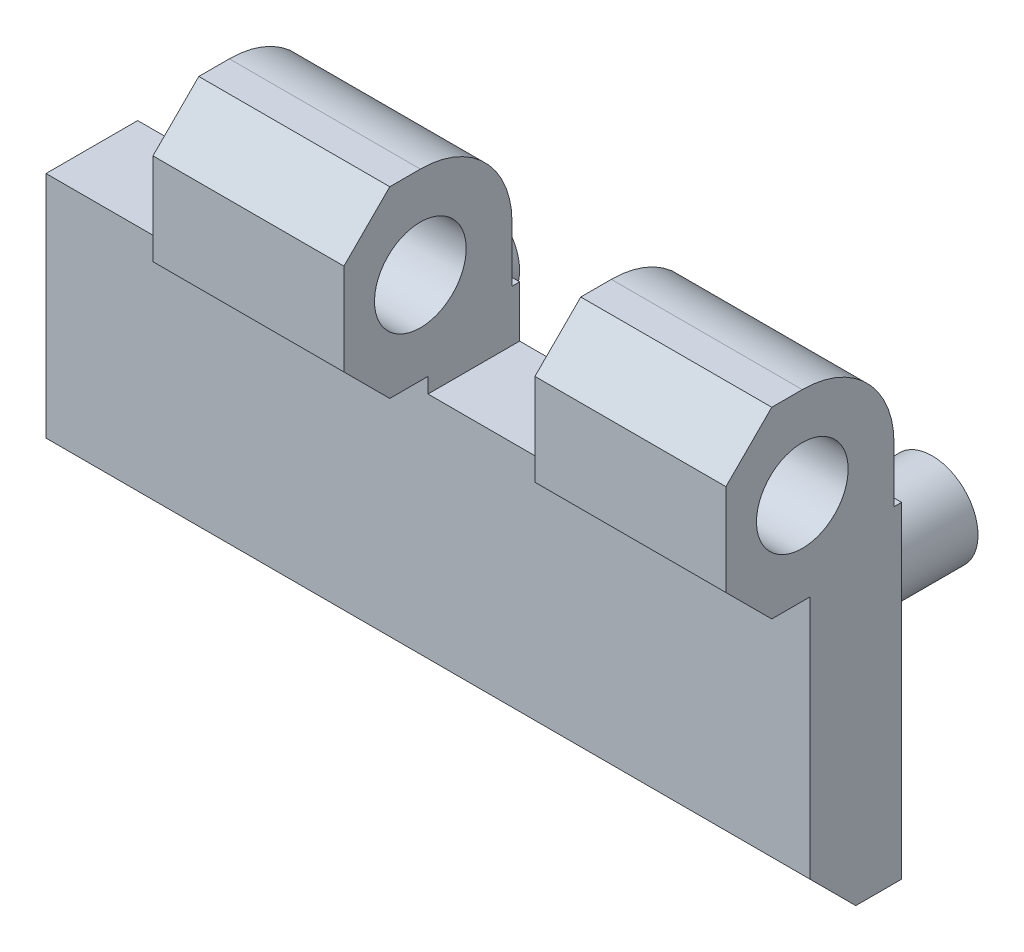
ISO-10303-21;
HEADER;
FILE_DESCRIPTION(('STEP AP214'),'2;1');
FILE_NAME('part.step','',(''),(''),'','','');
FILE_SCHEMA(('AUTOMOTIVE_DESIGN { 1 0 10303 214 1 1 1 1 }'));
ENDSEC;
DATA;
#1=APPLICATION_CONTEXT('core data for automotive mechanical design processes');
#2=APPLICATION_PROTOCOL_DEFINITION('international standard','automotive_design',2000,#1);
#3=PRODUCT_CONTEXT('',#1,'mechanical');
#4=PRODUCT('Part','Part','',(#3));
#5=PRODUCT_RELATED_PRODUCT_CATEGORY('part','',(#4));
#6=PRODUCT_DEFINITION_FORMATION('','',#4);
#7=PRODUCT_DEFINITION_CONTEXT('part definition',#1,'design');
#8=PRODUCT_DEFINITION('design','',#6,#7);
#9=PRODUCT_DEFINITION_SHAPE('','',#8);
#10=(LENGTH_UNIT() NAMED_UNIT(*) SI_UNIT(.MILLI.,.METRE.));
#11=(NAMED_UNIT(*) PLANE_ANGLE_UNIT() SI_UNIT($,.RADIAN.));
#12=(NAMED_UNIT(*) SI_UNIT($,.STERADIAN.) SOLID_ANGLE_UNIT());
#13=UNCERTAINTY_MEASURE_WITH_UNIT(LENGTH_MEASURE(1.E-05),#10,'distance_accuracy_value','');
#14=(GEOMETRIC_REPRESENTATION_CONTEXT(3) GLOBAL_UNCERTAINTY_ASSIGNED_CONTEXT((#13)) GLOBAL_UNIT_ASSIGNED_CONTEXT((#10,
#11,#12)) REPRESENTATION_CONTEXT('',''));
#15=CARTESIAN_POINT('',(0.,0.,0.));
#16=DIRECTION('',(0.,0.,1.));
#17=DIRECTION('',(1.,0.,0.));
#18=AXIS2_PLACEMENT_3D('',#15,#16,#17);
#19=CARTESIAN_POINT('',(-10.,-10.,0.));
#20=DIRECTION('',(0.,0.,-1.));
#21=DIRECTION('',(0.,1.,0.));
#22=AXIS2_PLACEMENT_3D('',#19,#20,#21);
#23=PLANE('',#22);
#24=DIRECTION('',(-1.,0.,0.));
#25=VECTOR('',#24,1.);
#26=CARTESIAN_POINT('',(-10.,8.,0.));
#27=LINE('',#26,#25);
#28=CARTESIAN_POINT('',(27.5,8.,0.));
#29=VERTEX_POINT('',#28);
#30=CARTESIAN_POINT('',(15.,8.,0.));
#31=VERTEX_POINT('',#30);
#32=EDGE_CURVE('E320',#29,#31,#27,.T.);
#33=ORIENTED_EDGE('',*,*,#32,.F.);
#34=DIRECTION('',(0.,1.,0.));
#35=VECTOR('',#34,1.);
#36=CARTESIAN_POINT('',(27.5,-10.,0.));
#37=LINE('',#36,#35);
#38=CARTESIAN_POINT('',(27.5,11.36,0.));
#39=VERTEX_POINT('',#38);
#40=EDGE_CURVE('E312',#29,#39,#37,.T.);
#41=ORIENTED_EDGE('',*,*,#40,.T.);
#42=DIRECTION('',(1.,0.,0.));
#43=VECTOR('',#42,1.);
#44=CARTESIAN_POINT('',(-10.,11.36,0.));
#45=LINE('',#44,#43);
#46=CARTESIAN_POINT('',(40.,11.36,0.));
#47=VERTEX_POINT('',#46);
#48=EDGE_CURVE('E351',#39,#47,#45,.T.);
#49=ORIENTED_EDGE('',*,*,#48,.T.);
#50=DIRECTION('',(0.,1.,0.));
#51=VECTOR('',#50,1.);
#52=CARTESIAN_POINT('',(40.,-10.,0.));
#53=LINE('',#52,#51);
#54=CARTESIAN_POINT('',(40.,-10.,0.));
#55=VERTEX_POINT('',#54);
#56=EDGE_CURVE('E194',#55,#47,#53,.T.);
#57=ORIENTED_EDGE('',*,*,#56,.F.);
#58=DIRECTION('',(1.,0.,0.));
#59=VECTOR('',#58,1.);
#60=CARTESIAN_POINT('',(-10.,-10.,0.));
#61=LINE('',#60,#59);
#62=CARTESIAN_POINT('',(-10.,-10.,0.));
#63=VERTEX_POINT('',#62);
#64=EDGE_CURVE('E189',#63,#55,#61,.T.);
#65=ORIENTED_EDGE('',*,*,#64,.F.);
#66=DIRECTION('',(0.,1.,0.));
#67=VECTOR('',#66,1.);
#68=CARTESIAN_POINT('',(-10.,-10.,0.));
#69=LINE('',#68,#67);
#70=CARTESIAN_POINT('',(-10.,8.,0.));
#71=VERTEX_POINT('',#70);
#72=EDGE_CURVE('E344',#63,#71,#69,.T.);
#73=ORIENTED_EDGE('',*,*,#72,.T.);
#74=DIRECTION('',(-1.,0.,0.));
#75=VECTOR('',#74,1.);
#76=CARTESIAN_POINT('',(-10.,8.,0.));
#77=LINE('',#76,#75);
#78=CARTESIAN_POINT('',(2.5,8.,0.));
#79=VERTEX_POINT('',#78);
#80=EDGE_CURVE('E318',#79,#71,#77,.T.);
#81=ORIENTED_EDGE('',*,*,#80,.F.);
#82=DIRECTION('',(0.,1.,0.));
#83=VECTOR('',#82,1.);
#84=CARTESIAN_POINT('',(2.5,-10.,0.));
#85=LINE('',#84,#83);
#86=CARTESIAN_POINT('',(2.5,11.36,0.));
#87=VERTEX_POINT('',#86);
#88=EDGE_CURVE('E266',#79,#87,#85,.T.);
#89=ORIENTED_EDGE('',*,*,#88,.T.);
#90=CARTESIAN_POINT('',(15.,11.36,0.));
#91=VERTEX_POINT('',#90);
#92=EDGE_CURVE('E353',#87,#91,#45,.T.);
#93=ORIENTED_EDGE('',*,*,#92,.T.);
#94=DIRECTION('',(0.,1.,0.));
#95=VECTOR('',#94,1.);
#96=CARTESIAN_POINT('',(15.,-10.,0.));
#97=LINE('',#96,#95);
#98=EDGE_CURVE('E291',#31,#91,#97,.T.);
#99=ORIENTED_EDGE('',*,*,#98,.F.);
#100=EDGE_LOOP('',(#33,#41,#49,#57,#65,#73,#81,#89,#93,#99));
#101=FACE_BOUND('',#100,.T.);
#102=CARTESIAN_POINT('',(30.,0.,0.));
#103=DIRECTION('',(0.,0.,-1.));
#104=DIRECTION('',(0.,1.,0.));
#105=AXIS2_PLACEMENT_3D('',#102,#103,#104);
#106=CIRCLE('',#105,3.);
#107=CARTESIAN_POINT('',(30.,3.,0.));
#108=VERTEX_POINT('',#107);
#109=EDGE_CURVE('E9',#108,#108,#106,.T.);
#110=ORIENTED_EDGE('',*,*,#109,.F.);
#111=EDGE_LOOP('',(#110));
#112=FACE_BOUND('',#111,.T.);
#113=CARTESIAN_POINT('',(0.,0.,0.));
#114=DIRECTION('',(0.,0.,-1.));
#115=DIRECTION('',(0.,1.,0.));
#116=AXIS2_PLACEMENT_3D('',#113,#114,#115);
#117=CIRCLE('',#116,3.);
#118=CARTESIAN_POINT('',(0.,3.,0.));
#119=VERTEX_POINT('',#118);
#120=EDGE_CURVE('E236',#119,#119,#117,.T.);
#121=ORIENTED_EDGE('',*,*,#120,.F.);
#122=EDGE_LOOP('',(#121));
#123=FACE_BOUND('',#122,.T.);
#124=ADVANCED_FACE('F14',(#101,#112,#123),#23,.T.);
#125=CARTESIAN_POINT('',(-10.,15.,6.5));
#126=DIRECTION('',(1.,0.,0.));
#127=DIRECTION('',(0.,1.,0.));
#128=AXIS2_PLACEMENT_3D('',#125,#126,#127);
#129=CYLINDRICAL_SURFACE('',#128,6.);
#130=DIRECTION('',(1.,0.,0.));
#131=VECTOR('',#130,1.);
#132=CARTESIAN_POINT('',(-10.,15.,0.5));
#133=LINE('',#132,#131);
#134=CARTESIAN_POINT('',(27.5,15.,0.5));
#135=VERTEX_POINT('',#134);
#136=CARTESIAN_POINT('',(40.,15.,0.5));
#137=VERTEX_POINT('',#136);
#138=EDGE_CURVE('E357',#135,#137,#133,.T.);
#139=ORIENTED_EDGE('',*,*,#138,.F.);
#140=CARTESIAN_POINT('',(27.5,15.,6.5));
#141=DIRECTION('',(-1.,0.,0.));
#142=DIRECTION('',(0.,-1.,0.));
#143=AXIS2_PLACEMENT_3D('',#140,#141,#142);
#144=CIRCLE('',#143,6.);
#145=CARTESIAN_POINT('',(27.5,21.,6.5));
#146=VERTEX_POINT('',#145);
#147=EDGE_CURVE('E300',#135,#146,#144,.F.);
#148=ORIENTED_EDGE('',*,*,#147,.T.);
#149=DIRECTION('',(1.,0.,0.));
#150=VECTOR('',#149,1.);
#151=CARTESIAN_POINT('',(-10.,21.,6.5));
#152=LINE('',#151,#150);
#153=CARTESIAN_POINT('',(40.,21.,6.5));
#154=VERTEX_POINT('',#153);
#155=EDGE_CURVE('E347',#146,#154,#152,.T.);
#156=ORIENTED_EDGE('',*,*,#155,.T.);
#157=CARTESIAN_POINT('',(40.,15.,6.5));
#158=DIRECTION('',(1.,0.,0.));
#159=DIRECTION('',(0.,1.,0.));
#160=AXIS2_PLACEMENT_3D('',#157,#158,#159);
#161=CIRCLE('',#160,6.);
#162=EDGE_CURVE('E325',#137,#154,#161,.T.);
#163=ORIENTED_EDGE('',*,*,#162,.F.);
#164=EDGE_LOOP('',(#139,#148,#156,#163));
#165=FACE_BOUND('',#164,.T.);
#166=ADVANCED_FACE('F468',(#165),#129,.T.);
#167=CARTESIAN_POINT('',(15.,15.,6.5));
#168=DIRECTION('',(-1.,0.,0.));
#169=DIRECTION('',(0.,-1.,0.));
#170=AXIS2_PLACEMENT_3D('',#167,#168,#169);
#171=CIRCLE('',#170,6.);
#172=CARTESIAN_POINT('',(15.,15.,0.5));
#173=VERTEX_POINT('',#172);
#174=CARTESIAN_POINT('',(15.,21.,6.5));
#175=VERTEX_POINT('',#174);
#176=EDGE_CURVE('E278',#173,#175,#171,.F.);
#177=ORIENTED_EDGE('',*,*,#176,.F.);
#178=CARTESIAN_POINT('',(2.5,15.,0.5));
#179=VERTEX_POINT('',#178);
#180=EDGE_CURVE('E359',#179,#173,#133,.T.);
#181=ORIENTED_EDGE('',*,*,#180,.F.);
#182=CARTESIAN_POINT('',(2.5,15.,6.5));
#183=DIRECTION('',(-1.,0.,0.));
#184=DIRECTION('',(0.,-1.,0.));
#185=AXIS2_PLACEMENT_3D('',#182,#183,#184);
#186=CIRCLE('',#185,6.);
#187=CARTESIAN_POINT('',(2.5,21.,6.5));
#188=VERTEX_POINT('',#187);
#189=EDGE_CURVE('E255',#179,#188,#186,.F.);
#190=ORIENTED_EDGE('',*,*,#189,.T.);
#191=EDGE_CURVE('E349',#188,#175,#152,.T.);
#192=ORIENTED_EDGE('',*,*,#191,.T.);
#193=EDGE_LOOP('',(#177,#181,#190,#192));
#194=FACE_BOUND('',#193,.T.);
#195=ADVANCED_FACE('F425',(#194),#129,.T.);
#196=CARTESIAN_POINT('',(-10.,15.,0.5));
#197=DIRECTION('',(0.,0.,1.));
#198=DIRECTION('',(0.,-1.,0.));
#199=AXIS2_PLACEMENT_3D('',#196,#197,#198);
#200=PLANE('',#199);
#201=DIRECTION('',(0.,-1.,0.));
#202=VECTOR('',#201,1.);
#203=CARTESIAN_POINT('',(27.5,15.,0.5));
#204=LINE('',#203,#202);
#205=CARTESIAN_POINT('',(27.5,11.36,0.5));
#206=VERTEX_POINT('',#205);
#207=EDGE_CURVE('E308',#135,#206,#204,.T.);
#208=ORIENTED_EDGE('',*,*,#207,.F.);
#209=ORIENTED_EDGE('',*,*,#138,.T.);
#210=DIRECTION('',(0.,-1.,0.));
#211=VECTOR('',#210,1.);
#212=CARTESIAN_POINT('',(40.,15.,0.5));
#213=LINE('',#212,#211);
#214=CARTESIAN_POINT('',(40.,11.36,0.5));
#215=VERTEX_POINT('',#214);
#216=EDGE_CURVE('E339',#137,#215,#213,.T.);
#217=ORIENTED_EDGE('',*,*,#216,.T.);
#218=DIRECTION('',(1.,0.,0.));
#219=VECTOR('',#218,1.);
#220=CARTESIAN_POINT('',(-10.,11.36,0.5));
#221=LINE('',#220,#219);
#222=EDGE_CURVE('E354',#206,#215,#221,.T.);
#223=ORIENTED_EDGE('',*,*,#222,.F.);
#224=EDGE_LOOP('',(#208,#209,#217,#223));
#225=FACE_BOUND('',#224,.T.);
#226=ADVANCED_FACE('F16',(#225),#200,.F.);
#227=ORIENTED_EDGE('',*,*,#180,.T.);
#228=DIRECTION('',(0.,-1.,0.));
#229=VECTOR('',#228,1.);
#230=CARTESIAN_POINT('',(15.,15.,0.5));
#231=LINE('',#230,#229);
#232=CARTESIAN_POINT('',(15.,11.36,0.5));
#233=VERTEX_POINT('',#232);
#234=EDGE_CURVE('E285',#173,#233,#231,.T.);
#235=ORIENTED_EDGE('',*,*,#234,.T.);
#236=CARTESIAN_POINT('',(2.5,11.36,0.5));
#237=VERTEX_POINT('',#236);
#238=EDGE_CURVE('E356',#237,#233,#221,.T.);
#239=ORIENTED_EDGE('',*,*,#238,.F.);
#240=DIRECTION('',(0.,-1.,0.));
#241=VECTOR('',#240,1.);
#242=CARTESIAN_POINT('',(2.5,15.,0.5));
#243=LINE('',#242,#241);
#244=EDGE_CURVE('E262',#179,#237,#243,.T.);
#245=ORIENTED_EDGE('',*,*,#244,.F.);
#246=EDGE_LOOP('',(#227,#235,#239,#245));
#247=FACE_BOUND('',#246,.T.);
#248=ADVANCED_FACE('F421',(#247),#200,.F.);
#249=CARTESIAN_POINT('',(-10.,11.36,0.5));
#250=DIRECTION('',(0.,-1.,0.));
#251=DIRECTION('',(1.,0.,0.));
#252=AXIS2_PLACEMENT_3D('',#249,#250,#251);
#253=PLANE('',#252);
#254=DIRECTION('',(0.,0.,-1.));
#255=VECTOR('',#254,1.);
#256=CARTESIAN_POINT('',(27.5,11.36,0.5));
#257=LINE('',#256,#255);
#258=EDGE_CURVE('E310',#206,#39,#257,.T.);
#259=ORIENTED_EDGE('',*,*,#258,.F.);
#260=ORIENTED_EDGE('',*,*,#222,.T.);
#261=DIRECTION('',(0.,0.,-1.));
#262=VECTOR('',#261,1.);
#263=CARTESIAN_POINT('',(40.,11.36,0.5));
#264=LINE('',#263,#262);
#265=EDGE_CURVE('E336',#215,#47,#264,.T.);
#266=ORIENTED_EDGE('',*,*,#265,.T.);
#267=ORIENTED_EDGE('',*,*,#48,.F.);
#268=EDGE_LOOP('',(#259,#260,#266,#267));
#269=FACE_BOUND('',#268,.T.);
#270=ADVANCED_FACE('F459',(#269),#253,.F.);
#271=ORIENTED_EDGE('',*,*,#238,.T.);
#272=DIRECTION('',(0.,0.,-1.));
#273=VECTOR('',#272,1.);
#274=CARTESIAN_POINT('',(15.,11.36,0.5));
#275=LINE('',#274,#273);
#276=EDGE_CURVE('E288',#233,#91,#275,.T.);
#277=ORIENTED_EDGE('',*,*,#276,.T.);
#278=ORIENTED_EDGE('',*,*,#92,.F.);
#279=DIRECTION('',(0.,0.,-1.));
#280=VECTOR('',#279,1.);
#281=CARTESIAN_POINT('',(2.5,11.36,0.5));
#282=LINE('',#281,#280);
#283=EDGE_CURVE('E264',#237,#87,#282,.T.);
#284=ORIENTED_EDGE('',*,*,#283,.F.);
#285=EDGE_LOOP('',(#271,#277,#278,#284));
#286=FACE_BOUND('',#285,.T.);
#287=ADVANCED_FACE('F412',(#286),#253,.F.);
#288=CARTESIAN_POINT('',(-10.,9.,11.5));
#289=DIRECTION('',(0.,-1.,0.));
#290=DIRECTION('',(1.,0.,0.));
#291=AXIS2_PLACEMENT_3D('',#288,#289,#290);
#292=PLANE('',#291);
#293=DIRECTION('',(-1.,0.,0.));
#294=VECTOR('',#293,1.);
#295=CARTESIAN_POINT('',(40.,9.,6.));
#296=LINE('',#295,#294);
#297=CARTESIAN_POINT('',(40.,9.,6.));
#298=VERTEX_POINT('',#297);
#299=CARTESIAN_POINT('',(27.5,9.,6.));
#300=VERTEX_POINT('',#299);
#301=EDGE_CURVE('E30',#298,#300,#296,.T.);
#302=ORIENTED_EDGE('',*,*,#301,.F.);
#303=DIRECTION('',(0.,0.,-1.));
#304=VECTOR('',#303,1.);
#305=CARTESIAN_POINT('',(40.,9.,11.5));
#306=LINE('',#305,#304);
#307=CARTESIAN_POINT('',(40.,9.,8.5));
#308=VERTEX_POINT('',#307);
#309=EDGE_CURVE('E195',#308,#298,#306,.T.);
#310=ORIENTED_EDGE('',*,*,#309,.F.);
#311=DIRECTION('',(-1.,0.,0.));
#312=VECTOR('',#311,1.);
#313=CARTESIAN_POINT('',(-10.,9.,8.5));
#314=LINE('',#313,#312);
#315=CARTESIAN_POINT('',(27.5,9.,8.5));
#316=VERTEX_POINT('',#315);
#317=EDGE_CURVE('E371',#308,#316,#314,.T.);
#318=ORIENTED_EDGE('',*,*,#317,.T.);
#319=DIRECTION('',(0.,0.,-1.));
#320=VECTOR('',#319,1.);
#321=CARTESIAN_POINT('',(27.5,9.,11.5));
#322=LINE('',#321,#320);
#323=EDGE_CURVE('E306',#316,#300,#322,.T.);
#324=ORIENTED_EDGE('',*,*,#323,.T.);
#325=EDGE_LOOP('',(#302,#310,#318,#324));
#326=FACE_BOUND('',#325,.T.);
#327=ADVANCED_FACE('F484',(#326),#292,.T.);
#328=DIRECTION('',(-1.,0.,0.));
#329=VECTOR('',#328,1.);
#330=CARTESIAN_POINT('',(15.,9.,6.));
#331=LINE('',#330,#329);
#332=CARTESIAN_POINT('',(15.,9.,6.));
#333=VERTEX_POINT('',#332);
#334=CARTESIAN_POINT('',(2.5,9.,6.));
#335=VERTEX_POINT('',#334);
#336=EDGE_CURVE('E222',#333,#335,#331,.T.);
#337=ORIENTED_EDGE('',*,*,#336,.F.);
#338=DIRECTION('',(0.,0.,-1.));
#339=VECTOR('',#338,1.);
#340=CARTESIAN_POINT('',(15.,9.,11.5));
#341=LINE('',#340,#339);
#342=CARTESIAN_POINT('',(15.,9.,8.5));
#343=VERTEX_POINT('',#342);
#344=EDGE_CURVE('E282',#343,#333,#341,.T.);
#345=ORIENTED_EDGE('',*,*,#344,.F.);
#346=CARTESIAN_POINT('',(2.5,9.,8.5));
#347=VERTEX_POINT('',#346);
#348=EDGE_CURVE('E375',#343,#347,#314,.T.);
#349=ORIENTED_EDGE('',*,*,#348,.T.);
#350=DIRECTION('',(0.,0.,-1.));
#351=VECTOR('',#350,1.);
#352=CARTESIAN_POINT('',(2.5,9.,11.5));
#353=LINE('',#352,#351);
#354=EDGE_CURVE('E38',#347,#335,#353,.T.);
#355=ORIENTED_EDGE('',*,*,#354,.T.);
#356=EDGE_LOOP('',(#337,#345,#349,#355));
#357=FACE_BOUND('',#356,.T.);
#358=ADVANCED_FACE('F447',(#357),#292,.T.);
#359=CARTESIAN_POINT('',(-10.,9.,11.5));
#360=DIRECTION('',(0.,0.,-1.));
#361=DIRECTION('',(-1.,0.,0.));
#362=AXIS2_PLACEMENT_3D('',#359,#360,#361);
#363=PLANE('',#362);
#364=DIRECTION('',(0.,1.,0.));
#365=VECTOR('',#364,1.);
#366=CARTESIAN_POINT('',(27.5,9.,11.5));
#367=LINE('',#366,#365);
#368=CARTESIAN_POINT('',(27.5,12.,11.5));
#369=VERTEX_POINT('',#368);
#370=CARTESIAN_POINT('',(27.5,18.,11.5));
#371=VERTEX_POINT('',#370);
#372=EDGE_CURVE('E298',#369,#371,#367,.T.);
#373=ORIENTED_EDGE('',*,*,#372,.F.);
#374=DIRECTION('',(1.,0.,0.));
#375=VECTOR('',#374,1.);
#376=CARTESIAN_POINT('',(40.,12.,11.5));
#377=LINE('',#376,#375);
#378=CARTESIAN_POINT('',(40.,12.,11.5));
#379=VERTEX_POINT('',#378);
#380=EDGE_CURVE('E368',#369,#379,#377,.T.);
#381=ORIENTED_EDGE('',*,*,#380,.T.);
#382=DIRECTION('',(0.,1.,0.));
#383=VECTOR('',#382,1.);
#384=CARTESIAN_POINT('',(40.,9.,11.5));
#385=LINE('',#384,#383);
#386=CARTESIAN_POINT('',(40.,18.,11.5));
#387=VERTEX_POINT('',#386);
#388=EDGE_CURVE('E331',#379,#387,#385,.T.);
#389=ORIENTED_EDGE('',*,*,#388,.T.);
#390=DIRECTION('',(-1.,0.,0.));
#391=VECTOR('',#390,1.);
#392=CARTESIAN_POINT('',(-10.,18.,11.5));
#393=LINE('',#392,#391);
#394=EDGE_CURVE('E365',#387,#371,#393,.T.);
#395=ORIENTED_EDGE('',*,*,#394,.T.);
#396=EDGE_LOOP('',(#373,#381,#389,#395));
#397=FACE_BOUND('',#396,.T.);
#398=ADVANCED_FACE('F479',(#397),#363,.F.);
#399=CARTESIAN_POINT('',(2.5,12.,11.5));
#400=VERTEX_POINT('',#399);
#401=CARTESIAN_POINT('',(15.,12.,11.5));
#402=VERTEX_POINT('',#401);
#403=EDGE_CURVE('E370',#400,#402,#377,.T.);
#404=ORIENTED_EDGE('',*,*,#403,.T.);
#405=DIRECTION('',(0.,1.,0.));
#406=VECTOR('',#405,1.);
#407=CARTESIAN_POINT('',(15.,9.,11.5));
#408=LINE('',#407,#406);
#409=CARTESIAN_POINT('',(15.,18.,11.5));
#410=VERTEX_POINT('',#409);
#411=EDGE_CURVE('E275',#402,#410,#408,.T.);
#412=ORIENTED_EDGE('',*,*,#411,.T.);
#413=CARTESIAN_POINT('',(2.5,18.,11.5));
#414=VERTEX_POINT('',#413);
#415=EDGE_CURVE('E364',#410,#414,#393,.T.);
#416=ORIENTED_EDGE('',*,*,#415,.T.);
#417=DIRECTION('',(0.,1.,0.));
#418=VECTOR('',#417,1.);
#419=CARTESIAN_POINT('',(2.5,9.,11.5));
#420=LINE('',#419,#418);
#421=EDGE_CURVE('E253',#400,#414,#420,.T.);
#422=ORIENTED_EDGE('',*,*,#421,.F.);
#423=EDGE_LOOP('',(#404,#412,#416,#422));
#424=FACE_BOUND('',#423,.T.);
#425=ADVANCED_FACE('F441',(#424),#363,.F.);
#426=CARTESIAN_POINT('',(-10.,21.,11.5));
#427=DIRECTION('',(0.,-1.,0.));
#428=DIRECTION('',(0.,0.,-1.));
#429=AXIS2_PLACEMENT_3D('',#426,#427,#428);
#430=PLANE('',#429);
#431=DIRECTION('',(0.,0.,-1.));
#432=VECTOR('',#431,1.);
#433=CARTESIAN_POINT('',(27.5,21.,11.5));
#434=LINE('',#433,#432);
#435=CARTESIAN_POINT('',(27.5,21.,8.5));
#436=VERTEX_POINT('',#435);
#437=EDGE_CURVE('E296',#436,#146,#434,.T.);
#438=ORIENTED_EDGE('',*,*,#437,.F.);
#439=DIRECTION('',(1.,0.,0.));
#440=VECTOR('',#439,1.);
#441=CARTESIAN_POINT('',(-10.,21.,8.5));
#442=LINE('',#441,#440);
#443=CARTESIAN_POINT('',(40.,21.,8.5));
#444=VERTEX_POINT('',#443);
#445=EDGE_CURVE('E374',#436,#444,#442,.T.);
#446=ORIENTED_EDGE('',*,*,#445,.T.);
#447=DIRECTION('',(0.,0.,-1.));
#448=VECTOR('',#447,1.);
#449=CARTESIAN_POINT('',(40.,21.,11.5));
#450=LINE('',#449,#448);
#451=EDGE_CURVE('E328',#444,#154,#450,.T.);
#452=ORIENTED_EDGE('',*,*,#451,.T.);
#453=ORIENTED_EDGE('',*,*,#155,.F.);
#454=EDGE_LOOP('',(#438,#446,#452,#453));
#455=FACE_BOUND('',#454,.T.);
#456=ADVANCED_FACE('F475',(#455),#430,.F.);
#457=CARTESIAN_POINT('',(2.5,21.,8.5));
#458=VERTEX_POINT('',#457);
#459=CARTESIAN_POINT('',(15.,21.,8.5));
#460=VERTEX_POINT('',#459);
#461=EDGE_CURVE('E377',#458,#460,#442,.T.);
#462=ORIENTED_EDGE('',*,*,#461,.T.);
#463=DIRECTION('',(0.,0.,-1.));
#464=VECTOR('',#463,1.);
#465=CARTESIAN_POINT('',(15.,21.,11.5));
#466=LINE('',#465,#464);
#467=EDGE_CURVE('E272',#460,#175,#466,.T.);
#468=ORIENTED_EDGE('',*,*,#467,.T.);
#469=ORIENTED_EDGE('',*,*,#191,.F.);
#470=DIRECTION('',(0.,0.,-1.));
#471=VECTOR('',#470,1.);
#472=CARTESIAN_POINT('',(2.5,21.,11.5));
#473=LINE('',#472,#471);
#474=EDGE_CURVE('E251',#458,#188,#473,.T.);
#475=ORIENTED_EDGE('',*,*,#474,.F.);
#476=EDGE_LOOP('',(#462,#468,#469,#475));
#477=FACE_BOUND('',#476,.T.);
#478=ADVANCED_FACE('F431',(#477),#430,.F.);
#479=CARTESIAN_POINT('',(-10.,15.,6.5));
#480=DIRECTION('',(1.,0.,0.));
#481=DIRECTION('',(0.,1.,0.));
#482=AXIS2_PLACEMENT_3D('',#479,#480,#481);
#483=CYLINDRICAL_SURFACE('',#482,3.);
#484=CARTESIAN_POINT('',(40.,15.,6.5));
#485=DIRECTION('',(1.,0.,0.));
#486=DIRECTION('',(0.,1.,0.));
#487=AXIS2_PLACEMENT_3D('',#484,#485,#486);
#488=CIRCLE('',#487,3.);
#489=CARTESIAN_POINT('',(40.,18.,6.5));
#490=VERTEX_POINT('',#489);
#491=EDGE_CURVE('E322',#490,#490,#488,.T.);
#492=ORIENTED_EDGE('',*,*,#491,.T.);
#493=EDGE_LOOP('',(#492));
#494=FACE_BOUND('',#493,.T.);
#495=CARTESIAN_POINT('',(27.5,15.,6.5));
#496=DIRECTION('',(-1.,0.,0.));
#497=DIRECTION('',(0.,-1.,0.));
#498=AXIS2_PLACEMENT_3D('',#495,#496,#497);
#499=CIRCLE('',#498,3.);
#500=CARTESIAN_POINT('',(27.5,12.,6.5));
#501=VERTEX_POINT('',#500);
#502=EDGE_CURVE('E315',#501,#501,#499,.F.);
#503=ORIENTED_EDGE('',*,*,#502,.F.);
#504=EDGE_LOOP('',(#503));
#505=FACE_BOUND('',#504,.T.);
#506=ADVANCED_FACE('F492',(#494,#505),#483,.F.);
#507=CARTESIAN_POINT('',(-10.,12.,11.5));
#508=DIRECTION('',(0.,-0.707106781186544,0.707106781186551));
#509=DIRECTION('',(0.,-0.707106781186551,-0.707106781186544));
#510=AXIS2_PLACEMENT_3D('',#507,#508,#509);
#511=PLANE('',#510);
#512=ORIENTED_EDGE('',*,*,#380,.F.);
#513=DIRECTION('',(0.,-0.707106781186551,-0.707106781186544));
#514=VECTOR('',#513,1.);
#515=CARTESIAN_POINT('',(27.5,12.,11.5));
#516=LINE('',#515,#514);
#517=EDGE_CURVE('E303',#369,#316,#516,.T.);
#518=ORIENTED_EDGE('',*,*,#517,.T.);
#519=ORIENTED_EDGE('',*,*,#317,.F.);
#520=DIRECTION('',(0.,-0.707106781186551,-0.707106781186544));
#521=VECTOR('',#520,1.);
#522=CARTESIAN_POINT('',(40.,11.,10.5));
#523=LINE('',#522,#521);
#524=EDGE_CURVE('E362',#379,#308,#523,.T.);
#525=ORIENTED_EDGE('',*,*,#524,.F.);
#526=EDGE_LOOP('',(#512,#518,#519,#525));
#527=FACE_BOUND('',#526,.T.);
#528=ADVANCED_FACE('F485',(#527),#511,.T.);
#529=DIRECTION('',(0.,-0.707106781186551,-0.707106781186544));
#530=VECTOR('',#529,1.);
#531=CARTESIAN_POINT('',(15.,12.,11.5));
#532=LINE('',#531,#530);
#533=EDGE_CURVE('E280',#402,#343,#532,.T.);
#534=ORIENTED_EDGE('',*,*,#533,.F.);
#535=ORIENTED_EDGE('',*,*,#403,.F.);
#536=DIRECTION('',(0.,-0.707106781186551,-0.707106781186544));
#537=VECTOR('',#536,1.);
#538=CARTESIAN_POINT('',(2.5,12.,11.5));
#539=LINE('',#538,#537);
#540=EDGE_CURVE('E258',#400,#347,#539,.T.);
#541=ORIENTED_EDGE('',*,*,#540,.T.);
#542=ORIENTED_EDGE('',*,*,#348,.F.);
#543=EDGE_LOOP('',(#534,#535,#541,#542));
#544=FACE_BOUND('',#543,.T.);
#545=ADVANCED_FACE('F448',(#544),#511,.T.);
#546=CARTESIAN_POINT('',(-10.,21.,8.5));
#547=DIRECTION('',(0.,-0.707106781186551,-0.707106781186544));
#548=DIRECTION('',(0.,0.707106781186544,-0.707106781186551));
#549=AXIS2_PLACEMENT_3D('',#546,#547,#548);
#550=PLANE('',#549);
#551=ORIENTED_EDGE('',*,*,#445,.F.);
#552=DIRECTION('',(0.,0.707106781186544,-0.707106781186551));
#553=VECTOR('',#552,1.);
#554=CARTESIAN_POINT('',(27.5,21.,8.5));
#555=LINE('',#554,#553);
#556=EDGE_CURVE('E382',#436,#371,#555,.F.);
#557=ORIENTED_EDGE('',*,*,#556,.T.);
#558=ORIENTED_EDGE('',*,*,#394,.F.);
#559=DIRECTION('',(0.,0.707106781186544,-0.707106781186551));
#560=VECTOR('',#559,1.);
#561=CARTESIAN_POINT('',(40.,19.,10.5));
#562=LINE('',#561,#560);
#563=EDGE_CURVE('E360',#444,#387,#562,.F.);
#564=ORIENTED_EDGE('',*,*,#563,.F.);
#565=EDGE_LOOP('',(#551,#557,#558,#564));
#566=FACE_BOUND('',#565,.T.);
#567=ADVANCED_FACE('F476',(#566),#550,.F.);
#568=DIRECTION('',(0.,0.707106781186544,-0.707106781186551));
#569=VECTOR('',#568,1.);
#570=CARTESIAN_POINT('',(15.,21.,8.5));
#571=LINE('',#570,#569);
#572=EDGE_CURVE('E381',#460,#410,#571,.F.);
#573=ORIENTED_EDGE('',*,*,#572,.F.);
#574=ORIENTED_EDGE('',*,*,#461,.F.);
#575=DIRECTION('',(0.,0.707106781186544,-0.707106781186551));
#576=VECTOR('',#575,1.);
#577=CARTESIAN_POINT('',(2.5,21.,8.5));
#578=LINE('',#577,#576);
#579=EDGE_CURVE('E378',#458,#414,#578,.F.);
#580=ORIENTED_EDGE('',*,*,#579,.T.);
#581=ORIENTED_EDGE('',*,*,#415,.F.);
#582=EDGE_LOOP('',(#573,#574,#580,#581));
#583=FACE_BOUND('',#582,.T.);
#584=ADVANCED_FACE('F435',(#583),#550,.F.);
#585=CARTESIAN_POINT('',(-10.,-10.,0.));
#586=DIRECTION('',(0.,1.,0.));
#587=DIRECTION('',(-1.,0.,0.));
#588=AXIS2_PLACEMENT_3D('',#585,#586,#587);
#589=PLANE('',#588);
#590=DIRECTION('',(0.,0.,1.));
#591=VECTOR('',#590,1.);
#592=CARTESIAN_POINT('',(40.,-10.,0.));
#593=LINE('',#592,#591);
#594=CARTESIAN_POINT('',(40.,-10.,3.));
#595=VERTEX_POINT('',#594);
#596=EDGE_CURVE('E183',#55,#595,#593,.T.);
#597=ORIENTED_EDGE('',*,*,#596,.T.);
#598=DIRECTION('',(-1.,0.,0.));
#599=VECTOR('',#598,1.);
#600=CARTESIAN_POINT('',(40.,-10.,3.));
#601=LINE('',#600,#599);
#602=CARTESIAN_POINT('',(-10.,-10.,3.));
#603=VERTEX_POINT('',#602);
#604=EDGE_CURVE('E187',#595,#603,#601,.T.);
#605=ORIENTED_EDGE('',*,*,#604,.T.);
#606=DIRECTION('',(0.,0.,1.));
#607=VECTOR('',#606,1.);
#608=CARTESIAN_POINT('',(-10.,-10.,0.));
#609=LINE('',#608,#607);
#610=EDGE_CURVE('E342',#63,#603,#609,.T.);
#611=ORIENTED_EDGE('',*,*,#610,.F.);
#612=ORIENTED_EDGE('',*,*,#64,.T.);
#613=EDGE_LOOP('',(#597,#605,#611,#612));
#614=FACE_BOUND('',#613,.T.);
#615=ADVANCED_FACE('F185',(#614),#589,.F.);
#616=CARTESIAN_POINT('',(-10.,15.,6.5));
#617=DIRECTION('',(1.,0.,0.));
#618=DIRECTION('',(0.,1.,0.));
#619=AXIS2_PLACEMENT_3D('',#616,#617,#618);
#620=PLANE('',#619);
#621=ORIENTED_EDGE('',*,*,#610,.T.);
#622=DIRECTION('',(0.,0.707106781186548,0.707106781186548));
#623=VECTOR('',#622,1.);
#624=CARTESIAN_POINT('',(-10.,-10.,3.));
#625=LINE('',#624,#623);
#626=CARTESIAN_POINT('',(-10.,-7.,6.));
#627=VERTEX_POINT('',#626);
#628=EDGE_CURVE('E202',#603,#627,#625,.T.);
#629=ORIENTED_EDGE('',*,*,#628,.T.);
#630=DIRECTION('',(0.,-1.,0.));
#631=VECTOR('',#630,1.);
#632=CARTESIAN_POINT('',(-10.,8.,6.));
#633=LINE('',#632,#631);
#634=CARTESIAN_POINT('',(-10.,8.,6.));
#635=VERTEX_POINT('',#634);
#636=EDGE_CURVE('E230',#635,#627,#633,.T.);
#637=ORIENTED_EDGE('',*,*,#636,.F.);
#638=DIRECTION('',(0.,0.,-1.));
#639=VECTOR('',#638,1.);
#640=CARTESIAN_POINT('',(-10.,8.,6.5));
#641=LINE('',#640,#639);
#642=EDGE_CURVE('E18',#635,#71,#641,.T.);
#643=ORIENTED_EDGE('',*,*,#642,.T.);
#644=ORIENTED_EDGE('',*,*,#72,.F.);
#645=EDGE_LOOP('',(#621,#629,#637,#643,#644));
#646=FACE_BOUND('',#645,.T.);
#647=ADVANCED_FACE('F391',(#646),#620,.F.);
#648=CARTESIAN_POINT('',(40.,15.,6.5));
#649=DIRECTION('',(1.,0.,0.));
#650=DIRECTION('',(0.,1.,0.));
#651=AXIS2_PLACEMENT_3D('',#648,#649,#650);
#652=PLANE('',#651);
#653=DIRECTION('',(0.,0.707106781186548,0.707106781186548));
#654=VECTOR('',#653,1.);
#655=CARTESIAN_POINT('',(40.,-10.,3.));
#656=LINE('',#655,#654);
#657=CARTESIAN_POINT('',(40.,-7.,6.));
#658=VERTEX_POINT('',#657);
#659=EDGE_CURVE('E199',#595,#658,#656,.T.);
#660=ORIENTED_EDGE('',*,*,#659,.F.);
#661=ORIENTED_EDGE('',*,*,#596,.F.);
#662=ORIENTED_EDGE('',*,*,#56,.T.);
#663=ORIENTED_EDGE('',*,*,#265,.F.);
#664=ORIENTED_EDGE('',*,*,#216,.F.);
#665=ORIENTED_EDGE('',*,*,#162,.T.);
#666=ORIENTED_EDGE('',*,*,#451,.F.);
#667=ORIENTED_EDGE('',*,*,#563,.T.);
#668=ORIENTED_EDGE('',*,*,#388,.F.);
#669=ORIENTED_EDGE('',*,*,#524,.T.);
#670=ORIENTED_EDGE('',*,*,#309,.T.);
#671=DIRECTION('',(0.,1.,0.));
#672=VECTOR('',#671,1.);
#673=CARTESIAN_POINT('',(40.,-7.,6.));
#674=LINE('',#673,#672);
#675=EDGE_CURVE('E208',#658,#298,#674,.T.);
#676=ORIENTED_EDGE('',*,*,#675,.F.);
#677=EDGE_LOOP('',(#660,#661,#662,#663,#664,#665,#666,#667,#668,#669,#670,#676));
#678=FACE_BOUND('',#677,.T.);
#679=ORIENTED_EDGE('',*,*,#491,.F.);
#680=EDGE_LOOP('',(#679));
#681=FACE_BOUND('',#680,.T.);
#682=ADVANCED_FACE('F205',(#678,#681),#652,.T.);
#683=CARTESIAN_POINT('',(2.5,35.,-8.5));
#684=DIRECTION('',(-1.,0.,0.));
#685=DIRECTION('',(0.,-1.,0.));
#686=AXIS2_PLACEMENT_3D('',#683,#684,#685);
#687=PLANE('',#686);
#688=DIRECTION('',(0.,0.,1.));
#689=VECTOR('',#688,1.);
#690=CARTESIAN_POINT('',(2.5,8.,-8.5));
#691=LINE('',#690,#689);
#692=CARTESIAN_POINT('',(2.5,8.,6.));
#693=VERTEX_POINT('',#692);
#694=EDGE_CURVE('E245',#79,#693,#691,.T.);
#695=ORIENTED_EDGE('',*,*,#694,.T.);
#696=DIRECTION('',(0.,-1.,0.));
#697=VECTOR('',#696,1.);
#698=CARTESIAN_POINT('',(2.5,9.,6.));
#699=LINE('',#698,#697);
#700=EDGE_CURVE('E224',#335,#693,#699,.T.);
#701=ORIENTED_EDGE('',*,*,#700,.F.);
#702=ORIENTED_EDGE('',*,*,#354,.F.);
#703=ORIENTED_EDGE('',*,*,#540,.F.);
#704=ORIENTED_EDGE('',*,*,#421,.T.);
#705=ORIENTED_EDGE('',*,*,#579,.F.);
#706=ORIENTED_EDGE('',*,*,#474,.T.);
#707=ORIENTED_EDGE('',*,*,#189,.F.);
#708=ORIENTED_EDGE('',*,*,#244,.T.);
#709=ORIENTED_EDGE('',*,*,#283,.T.);
#710=ORIENTED_EDGE('',*,*,#88,.F.);
#711=EDGE_LOOP('',(#695,#701,#702,#703,#704,#705,#706,#707,#708,#709,#710));
#712=FACE_BOUND('',#711,.T.);
#713=CARTESIAN_POINT('',(2.5,15.,6.5));
#714=DIRECTION('',(-1.,0.,0.));
#715=DIRECTION('',(0.,-1.,0.));
#716=AXIS2_PLACEMENT_3D('',#713,#714,#715);
#717=CIRCLE('',#716,3.);
#718=CARTESIAN_POINT('',(2.5,12.,6.5));
#719=VERTEX_POINT('',#718);
#720=EDGE_CURVE('E269',#719,#719,#717,.F.);
#721=ORIENTED_EDGE('',*,*,#720,.T.);
#722=EDGE_LOOP('',(#721));
#723=FACE_BOUND('',#722,.T.);
#724=ADVANCED_FACE('F404',(#712,#723),#687,.T.);
#725=CARTESIAN_POINT('',(-30.,8.,-8.5));
#726=DIRECTION('',(0.,-1.,0.));
#727=DIRECTION('',(1.,0.,0.));
#728=AXIS2_PLACEMENT_3D('',#725,#726,#727);
#729=PLANE('',#728);
#730=ORIENTED_EDGE('',*,*,#80,.T.);
#731=ORIENTED_EDGE('',*,*,#642,.F.);
#732=DIRECTION('',(-1.,0.,0.));
#733=VECTOR('',#732,1.);
#734=CARTESIAN_POINT('',(2.5,8.,6.));
#735=LINE('',#734,#733);
#736=EDGE_CURVE('E227',#693,#635,#735,.T.);
#737=ORIENTED_EDGE('',*,*,#736,.F.);
#738=ORIENTED_EDGE('',*,*,#694,.F.);
#739=EDGE_LOOP('',(#730,#731,#737,#738));
#740=FACE_BOUND('',#739,.T.);
#741=ADVANCED_FACE('F402',(#740),#729,.F.);
#742=CARTESIAN_POINT('',(15.,8.,-8.5));
#743=DIRECTION('',(0.,-1.,0.));
#744=DIRECTION('',(1.,0.,0.));
#745=AXIS2_PLACEMENT_3D('',#742,#743,#744);
#746=PLANE('',#745);
#747=ORIENTED_EDGE('',*,*,#32,.T.);
#748=DIRECTION('',(0.,0.,1.));
#749=VECTOR('',#748,1.);
#750=CARTESIAN_POINT('',(15.,8.,-8.5));
#751=LINE('',#750,#749);
#752=CARTESIAN_POINT('',(15.,8.,6.));
#753=VERTEX_POINT('',#752);
#754=EDGE_CURVE('E247',#31,#753,#751,.T.);
#755=ORIENTED_EDGE('',*,*,#754,.T.);
#756=DIRECTION('',(-1.,0.,0.));
#757=VECTOR('',#756,1.);
#758=CARTESIAN_POINT('',(27.5,8.,6.));
#759=LINE('',#758,#757);
#760=CARTESIAN_POINT('',(27.5,8.,6.));
#761=VERTEX_POINT('',#760);
#762=EDGE_CURVE('E216',#761,#753,#759,.T.);
#763=ORIENTED_EDGE('',*,*,#762,.F.);
#764=DIRECTION('',(0.,0.,1.));
#765=VECTOR('',#764,1.);
#766=CARTESIAN_POINT('',(27.5,8.,-8.5));
#767=LINE('',#766,#765);
#768=EDGE_CURVE('E249',#29,#761,#767,.T.);
#769=ORIENTED_EDGE('',*,*,#768,.F.);
#770=EDGE_LOOP('',(#747,#755,#763,#769));
#771=FACE_BOUND('',#770,.T.);
#772=ADVANCED_FACE('F454',(#771),#746,.F.);
#773=CARTESIAN_POINT('',(27.5,35.,-8.5));
#774=DIRECTION('',(-1.,0.,0.));
#775=DIRECTION('',(0.,-1.,0.));
#776=AXIS2_PLACEMENT_3D('',#773,#774,#775);
#777=PLANE('',#776);
#778=ORIENTED_EDGE('',*,*,#768,.T.);
#779=DIRECTION('',(0.,-1.,0.));
#780=VECTOR('',#779,1.);
#781=CARTESIAN_POINT('',(27.5,9.,6.));
#782=LINE('',#781,#780);
#783=EDGE_CURVE('E213',#300,#761,#782,.T.);
#784=ORIENTED_EDGE('',*,*,#783,.F.);
#785=ORIENTED_EDGE('',*,*,#323,.F.);
#786=ORIENTED_EDGE('',*,*,#517,.F.);
#787=ORIENTED_EDGE('',*,*,#372,.T.);
#788=ORIENTED_EDGE('',*,*,#556,.F.);
#789=ORIENTED_EDGE('',*,*,#437,.T.);
#790=ORIENTED_EDGE('',*,*,#147,.F.);
#791=ORIENTED_EDGE('',*,*,#207,.T.);
#792=ORIENTED_EDGE('',*,*,#258,.T.);
#793=ORIENTED_EDGE('',*,*,#40,.F.);
#794=EDGE_LOOP('',(#778,#784,#785,#786,#787,#788,#789,#790,#791,#792,#793));
#795=FACE_BOUND('',#794,.T.);
#796=ORIENTED_EDGE('',*,*,#502,.T.);
#797=EDGE_LOOP('',(#796));
#798=FACE_BOUND('',#797,.T.);
#799=ADVANCED_FACE('F486',(#795,#798),#777,.T.);
#800=CARTESIAN_POINT('',(15.,35.,-8.5));
#801=DIRECTION('',(-1.,0.,0.));
#802=DIRECTION('',(0.,-1.,0.));
#803=AXIS2_PLACEMENT_3D('',#800,#801,#802);
#804=PLANE('',#803);
#805=ORIENTED_EDGE('',*,*,#98,.T.);
#806=ORIENTED_EDGE('',*,*,#276,.F.);
#807=ORIENTED_EDGE('',*,*,#234,.F.);
#808=ORIENTED_EDGE('',*,*,#176,.T.);
#809=ORIENTED_EDGE('',*,*,#467,.F.);
#810=ORIENTED_EDGE('',*,*,#572,.T.);
#811=ORIENTED_EDGE('',*,*,#411,.F.);
#812=ORIENTED_EDGE('',*,*,#533,.T.);
#813=ORIENTED_EDGE('',*,*,#344,.T.);
#814=DIRECTION('',(0.,1.,0.));
#815=VECTOR('',#814,1.);
#816=CARTESIAN_POINT('',(15.,8.,6.));
#817=LINE('',#816,#815);
#818=EDGE_CURVE('E219',#753,#333,#817,.T.);
#819=ORIENTED_EDGE('',*,*,#818,.F.);
#820=ORIENTED_EDGE('',*,*,#754,.F.);
#821=EDGE_LOOP('',(#805,#806,#807,#808,#809,#810,#811,#812,#813,#819,#820));
#822=FACE_BOUND('',#821,.T.);
#823=CARTESIAN_POINT('',(15.,15.,6.5));
#824=DIRECTION('',(-1.,0.,0.));
#825=DIRECTION('',(0.,-1.,0.));
#826=AXIS2_PLACEMENT_3D('',#823,#824,#825);
#827=CIRCLE('',#826,3.);
#828=CARTESIAN_POINT('',(15.,12.,6.5));
#829=VERTEX_POINT('',#828);
#830=EDGE_CURVE('E293',#829,#829,#827,.F.);
#831=ORIENTED_EDGE('',*,*,#830,.F.);
#832=EDGE_LOOP('',(#831));
#833=FACE_BOUND('',#832,.T.);
#834=ADVANCED_FACE('F415',(#822,#833),#804,.F.);
#835=ORIENTED_EDGE('',*,*,#830,.T.);
#836=EDGE_LOOP('',(#835));
#837=FACE_BOUND('',#836,.T.);
#838=ORIENTED_EDGE('',*,*,#720,.F.);
#839=EDGE_LOOP('',(#838));
#840=FACE_BOUND('',#839,.T.);
#841=ADVANCED_FACE('F496',(#837,#840),#483,.F.);
#842=CARTESIAN_POINT('',(30.,0.,-12.));
#843=DIRECTION('',(0.,0.,1.));
#844=DIRECTION('',(0.,-1.,0.));
#845=AXIS2_PLACEMENT_3D('',#842,#843,#844);
#846=CYLINDRICAL_SURFACE('',#845,3.);
#847=CARTESIAN_POINT('',(30.,0.,-12.));
#848=DIRECTION('',(0.,0.,-1.));
#849=DIRECTION('',(0.,1.,0.));
#850=AXIS2_PLACEMENT_3D('',#847,#848,#849);
#851=CIRCLE('',#850,3.);
#852=CARTESIAN_POINT('',(30.,3.,-12.));
#853=VERTEX_POINT('',#852);
#854=EDGE_CURVE('E241',#853,#853,#851,.T.);
#855=ORIENTED_EDGE('',*,*,#854,.F.);
#856=EDGE_LOOP('',(#855));
#857=FACE_BOUND('',#856,.T.);
#858=ORIENTED_EDGE('',*,*,#109,.T.);
#859=EDGE_LOOP('',(#858));
#860=FACE_BOUND('',#859,.T.);
#861=ADVANCED_FACE('F507',(#857,#860),#846,.T.);
#862=CARTESIAN_POINT('',(30.,0.,-12.));
#863=DIRECTION('',(0.,0.,-1.));
#864=DIRECTION('',(0.,1.,0.));
#865=AXIS2_PLACEMENT_3D('',#862,#863,#864);
#866=PLANE('',#865);
#867=ORIENTED_EDGE('',*,*,#854,.T.);
#868=EDGE_LOOP('',(#867));
#869=FACE_BOUND('',#868,.T.);
#870=ADVANCED_FACE('F509',(#869),#866,.T.);
#871=CARTESIAN_POINT('',(0.,0.,-12.));
#872=DIRECTION('',(0.,0.,1.));
#873=DIRECTION('',(0.,-1.,0.));
#874=AXIS2_PLACEMENT_3D('',#871,#872,#873);
#875=CYLINDRICAL_SURFACE('',#874,3.);
#876=CARTESIAN_POINT('',(0.,0.,-12.));
#877=DIRECTION('',(0.,0.,-1.));
#878=DIRECTION('',(0.,1.,0.));
#879=AXIS2_PLACEMENT_3D('',#876,#877,#878);
#880=CIRCLE('',#879,3.);
#881=CARTESIAN_POINT('',(0.,3.,-12.));
#882=VERTEX_POINT('',#881);
#883=EDGE_CURVE('E239',#882,#882,#880,.T.);
#884=ORIENTED_EDGE('',*,*,#883,.F.);
#885=EDGE_LOOP('',(#884));
#886=FACE_BOUND('',#885,.T.);
#887=ORIENTED_EDGE('',*,*,#120,.T.);
#888=EDGE_LOOP('',(#887));
#889=FACE_BOUND('',#888,.T.);
#890=ADVANCED_FACE('F690',(#886,#889),#875,.T.);
#891=CARTESIAN_POINT('',(0.,0.,-12.));
#892=DIRECTION('',(0.,0.,-1.));
#893=DIRECTION('',(0.,1.,0.));
#894=AXIS2_PLACEMENT_3D('',#891,#892,#893);
#895=PLANE('',#894);
#896=ORIENTED_EDGE('',*,*,#883,.T.);
#897=EDGE_LOOP('',(#896));
#898=FACE_BOUND('',#897,.T.);
#899=ADVANCED_FACE('F682',(#898),#895,.T.);
#900=CARTESIAN_POINT('',(0.,0.,6.));
#901=DIRECTION('',(0.,0.,1.));
#902=DIRECTION('',(1.,0.,0.));
#903=AXIS2_PLACEMENT_3D('',#900,#901,#902);
#904=PLANE('',#903);
#905=ORIENTED_EDGE('',*,*,#301,.T.);
#906=ORIENTED_EDGE('',*,*,#783,.T.);
#907=ORIENTED_EDGE('',*,*,#762,.T.);
#908=ORIENTED_EDGE('',*,*,#818,.T.);
#909=ORIENTED_EDGE('',*,*,#336,.T.);
#910=ORIENTED_EDGE('',*,*,#700,.T.);
#911=ORIENTED_EDGE('',*,*,#736,.T.);
#912=ORIENTED_EDGE('',*,*,#636,.T.);
#913=DIRECTION('',(1.,0.,0.));
#914=VECTOR('',#913,1.);
#915=CARTESIAN_POINT('',(-10.,-7.,6.));
#916=LINE('',#915,#914);
#917=EDGE_CURVE('E233',#627,#658,#916,.T.);
#918=ORIENTED_EDGE('',*,*,#917,.T.);
#919=ORIENTED_EDGE('',*,*,#675,.T.);
#920=EDGE_LOOP('',(#905,#906,#907,#908,#909,#910,#911,#912,#918,#919));
#921=FACE_BOUND('',#920,.T.);
#922=ADVANCED_FACE('F399',(#921),#904,.T.);
#923=CARTESIAN_POINT('',(40.,-10.,3.));
#924=DIRECTION('',(0.,-0.707106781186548,0.707106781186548));
#925=DIRECTION('',(0.,-0.707106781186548,-0.707106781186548));
#926=AXIS2_PLACEMENT_3D('',#923,#924,#925);
#927=PLANE('',#926);
#928=ORIENTED_EDGE('',*,*,#628,.F.);
#929=ORIENTED_EDGE('',*,*,#604,.F.);
#930=ORIENTED_EDGE('',*,*,#659,.T.);
#931=ORIENTED_EDGE('',*,*,#917,.F.);
#932=EDGE_LOOP('',(#928,#929,#930,#931));
#933=FACE_BOUND('',#932,.T.);
#934=ADVANCED_FACE('F198',(#933),#927,.T.);
#935=CLOSED_SHELL('',(#124,#166,#195,#226,#248,#270,#287,#327,#358,#398,#425,#456,#478,#506,
#528,#545,#567,#584,#615,#647,#682,#724,#741,#772,#799,#834,#841,#861,#870,#890,#899,#922,#934));
#936=MANIFOLD_SOLID_BREP('B1',#935);
#937=ADVANCED_BREP_SHAPE_REPRESENTATION('',(#18,#936),#14);
#938=SHAPE_DEFINITION_REPRESENTATION(#9,#937);
ENDSEC;
END-ISO-10303-21;
